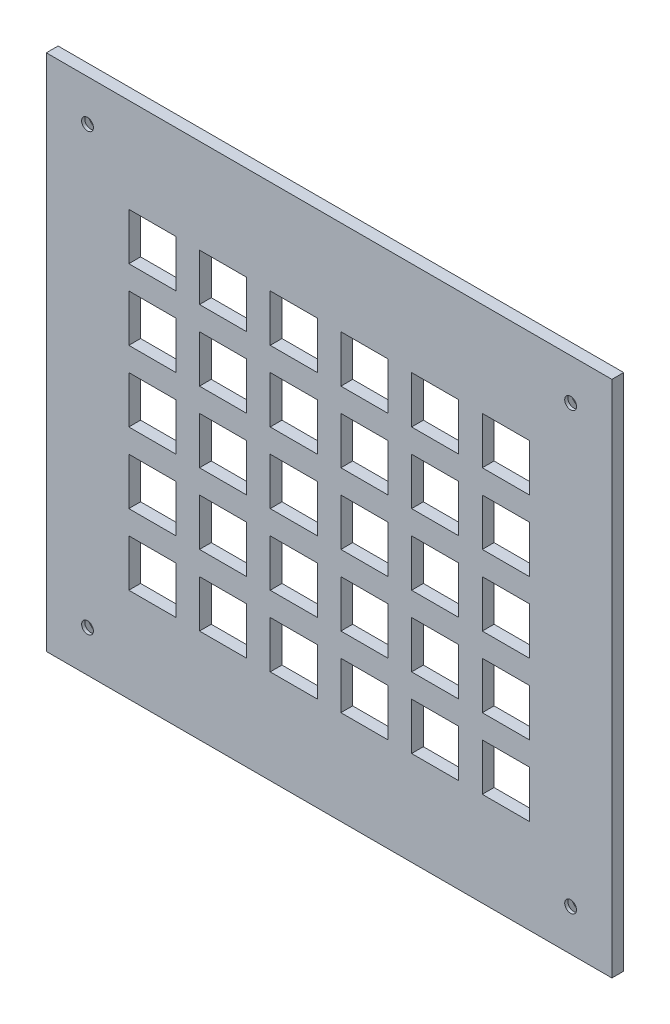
from build123d import *

# Parameters (mm, degrees)
SKETCH1_W            = 152.4
SKETCH1_H            = 139.7
BOSS_EXTRUDE1_DEPTH  = 3.175
SKETCH3_W            = 12.7
SKETCH3_H            = 12.7
CUT_EXTRUDE1_DEPTH   = 104.419258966
LPATTERN1_COUNT      = 2
LPATTERN1_PITCH      = 130.175
LPATTERN1_COUNT_DIR2 = 2
LPATTERN1_PITCH_DIR2 = 117.475


with BuildPart() as part:
    # Sketch1 → Boss-Extrude1 (new body)
    with BuildSketch(Plane.XY):
        Rectangle(SKETCH1_W, SKETCH1_H)
    extrude(amount=BOSS_EXTRUDE1_DEPTH)

    # Sketch3 → Cut-Extrude1 (cut, through all)
    with BuildSketch(Plane.XY.offset(3.175)):
        with Locations((-47.625, -38.1)):
            Rectangle(SKETCH3_W, SKETCH3_H)
        with Locations((-28.575, -38.1)):
            Rectangle(SKETCH3_W, SKETCH3_H)
        with Locations((-9.525, -38.1)):
            Rectangle(SKETCH3_W, SKETCH3_H)
        with Locations((9.525, -38.1)):
            Rectangle(SKETCH3_W, SKETCH3_H)
        with Locations((28.575, -38.1)):
            Rectangle(SKETCH3_W, SKETCH3_H)
        with Locations((47.625, -38.1)):
            Rectangle(SKETCH3_W, SKETCH3_H)
        with Locations((-28.575, -19.05)):
            Rectangle(SKETCH3_W, SKETCH3_H)
        with Locations((-9.525, -19.05)):
            Rectangle(SKETCH3_W, SKETCH3_H)
        with Locations((9.525, -19.05)):
            Rectangle(SKETCH3_W, SKETCH3_H)
        with Locations((28.575, -19.05)):
            Rectangle(SKETCH3_W, SKETCH3_H)
        with Locations((47.625, -19.05)):
            Rectangle(SKETCH3_W, SKETCH3_H)
        with Locations((-28.575, 0)):
            Rectangle(SKETCH3_W, SKETCH3_H)
        with Locations((-9.525, 0)):
            Rectangle(SKETCH3_W, SKETCH3_H)
        with Locations((9.525, 0)):
            Rectangle(SKETCH3_W, SKETCH3_H)
        with Locations((28.575, 0)):
            Rectangle(SKETCH3_W, SKETCH3_H)
        with Locations((47.625, 0)):
            Rectangle(SKETCH3_W, SKETCH3_H)
        with Locations((-28.575, 19.05)):
            Rectangle(SKETCH3_W, SKETCH3_H)
        with Locations((-9.525, 19.05)):
            Rectangle(SKETCH3_W, SKETCH3_H)
        with Locations((9.525, 19.05)):
            Rectangle(SKETCH3_W, SKETCH3_H)
        with Locations((28.575, 19.05)):
            Rectangle(SKETCH3_W, SKETCH3_H)
        with Locations((47.625, 19.05)):
            Rectangle(SKETCH3_W, SKETCH3_H)
        with Locations((-28.575, 38.1)):
            Rectangle(SKETCH3_W, SKETCH3_H)
        with Locations((-9.525, 38.1)):
            Rectangle(SKETCH3_W, SKETCH3_H)
        with Locations((9.525, 38.1)):
            Rectangle(SKETCH3_W, SKETCH3_H)
        with Locations((28.575, 38.1)):
            Rectangle(SKETCH3_W, SKETCH3_H)
        with Locations((47.625, 38.1)):
            Rectangle(SKETCH3_W, SKETCH3_H)
        with Locations((-47.625, -19.05)):
            Rectangle(SKETCH3_W, SKETCH3_H)
        with Locations((-47.625, 0)):
            Rectangle(SKETCH3_W, SKETCH3_H)
        with Locations((-47.625, 19.05)):
            Rectangle(SKETCH3_W, SKETCH3_H)
        with Locations((-47.625, 38.1)):
            Rectangle(SKETCH3_W, SKETCH3_H)
    extrude(amount=-CUT_EXTRUDE1_DEPTH, mode=Mode.SUBTRACT)

    # Sketch5 → Cut-Revolve1 (revolve, cut)
    with BuildSketch(Plane(origin=(0, -58.7248, 0), x_dir=(-1, 0, 0), z_dir=(0, -1, 0))):
        Polygon((-65.0748, -7.845711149), (-65.0748, 0), (-68.281579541, 0), (-66.665310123, -2.329409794), (-66.665310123, -7.448083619), (-66.267682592, -7.845711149), align=None)
    cut_revolve1 = revolve(axis=Axis((65.0748, -58.7248, 2.329409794), (0, 0, 1)), mode=Mode.SUBTRACT)

    # LPattern1: Cut-Revolve1 2 × 2
    with Locations(*[(-i * LPATTERN1_PITCH, j * LPATTERN1_PITCH_DIR2, 0) for i in range(LPATTERN1_COUNT) for j in range(LPATTERN1_COUNT_DIR2) if (i, j) != (0, 0)]):
        add(cut_revolve1, mode=Mode.SUBTRACT)


solid = part.part
